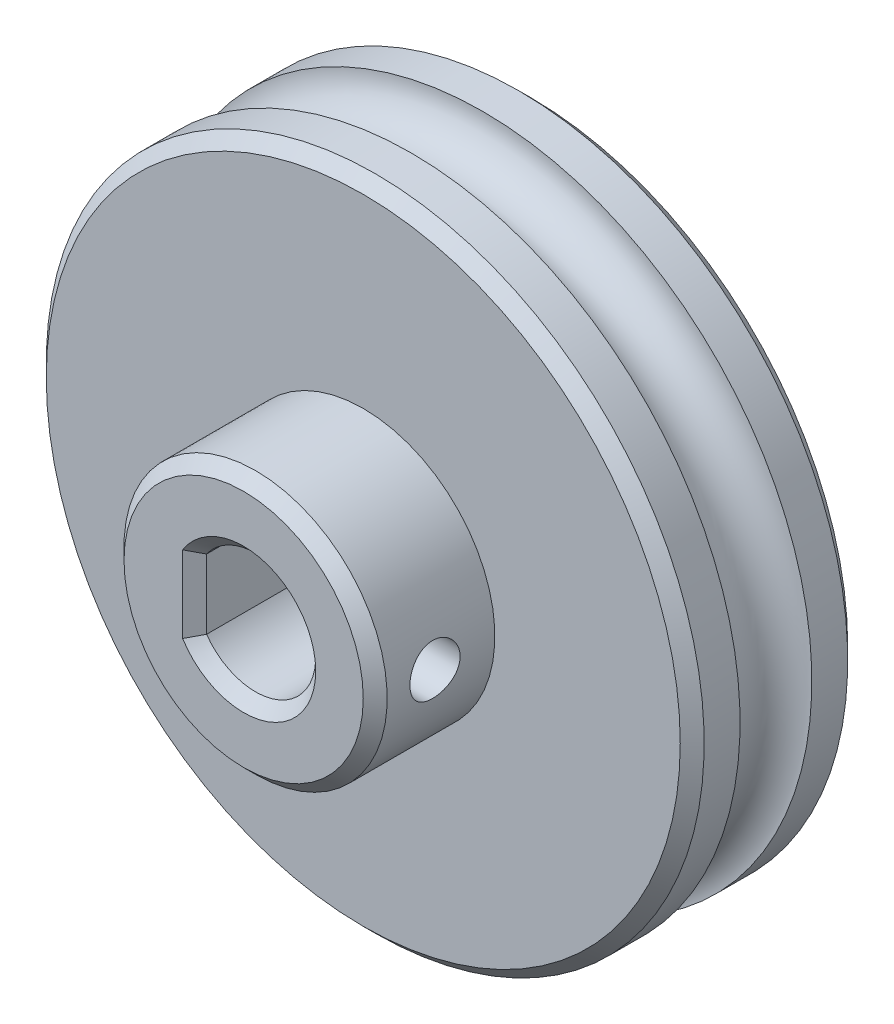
from build123d import *

# Parameters (mm, degrees)
CHAMFER1_SIZE           = 1
CUT_EXTRUDE1_DEPTH      = 46.700109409
CHAMFER2_SIZE           = 1
CUT_EXTRUDE2_REACH      = 50.278
CUT_EXTRUDE2_END_RADIUS = 11
SKETCH3_R               = 2.1


with BuildPart() as part:
    # Sketch1 → Revolve1 (revolve)
    with BuildSketch(Plane(origin=(0, 0, 0), x_dir=(0, 0, -1), z_dir=(1, 0, 0))):
        with BuildLine():
            Line((0, -27.5), (-4, -27.5))
            ThreePointArc((-4, -27.5), (-7, -24.5), (-10, -27.5))
            Line((-10, -27.5), (-14, -27.5))
            Line((-14, -27.5), (-14, -11))
            Line((-14, -11), (-24, -11))
            Line((-24, -11), (-24, 0))
            Line((-24, 0), (0, 0))
            Line((0, 0), (0, -27.5))
        make_face()
    revolve(axis=Axis((0, 0, 85.971244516), (0, 0, -1)))

    # Chamfer1
    chamfer1_edges = [part.edges().sort_by_distance(p)[0] for p in [
        (0, 27.5, 0),
        (0, 27.5, 14),
        (0, 11, 24),
    ]]
    chamfer(chamfer1_edges, length=CHAMFER1_SIZE)

    # Sketch2 → Cut-Extrude1 (cut, through all)
    with BuildSketch(Plane.XY.offset(24)):
        with BuildLine():
            Line((-4.1, 2.905275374), (-4.1, -2.905275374))
            ThreePointArc((-4.1, -2.905275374), (5.025, 0), (-4.1, 2.905275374))
        make_face()
    extrude(amount=-CUT_EXTRUDE1_DEPTH, mode=Mode.SUBTRACT)

    # Chamfer2
    chamfer2_edges = [part.edges().sort_by_distance(p)[0] for p in [
        (5.025, 0, 0),
        (-4.1, 0, 0),
        (5.025, 0, 24),
        (-4.1, 0, 24),
    ]]
    chamfer(chamfer2_edges, length=CHAMFER2_SIZE)

    # Cut-Extrude2: up to this cylinder (the profile starts inside it)
    cut_extrude2_end = Plane(origin=(0, 0, 19), z_dir=(0, 0, 1)) * Cylinder(CUT_EXTRUDE2_END_RADIUS, 123.556, mode=Mode.PRIVATE)
    # Sketch3 → Cut-Extrude2 (cut, up to the surface)
    with BuildSketch(Plane(origin=(-4.1, 0, 0), x_dir=(0, 0, -1), z_dir=(1, 0, 0)), mode=Mode.PRIVATE) as cut_extrude2_sk1:
        with Locations(Location((-19, 0, 0), (0, 0, 180))):
            Circle(SKETCH3_R)
    cut_extrude2_tool1 = extrude(cut_extrude2_sk1.sketch, amount=CUT_EXTRUDE2_REACH, mode=Mode.PRIVATE) & cut_extrude2_end
    add(cut_extrude2_tool1.solids().sort_by_distance((-4.1, 0, 19))[0], mode=Mode.SUBTRACT)


solid = part.part
